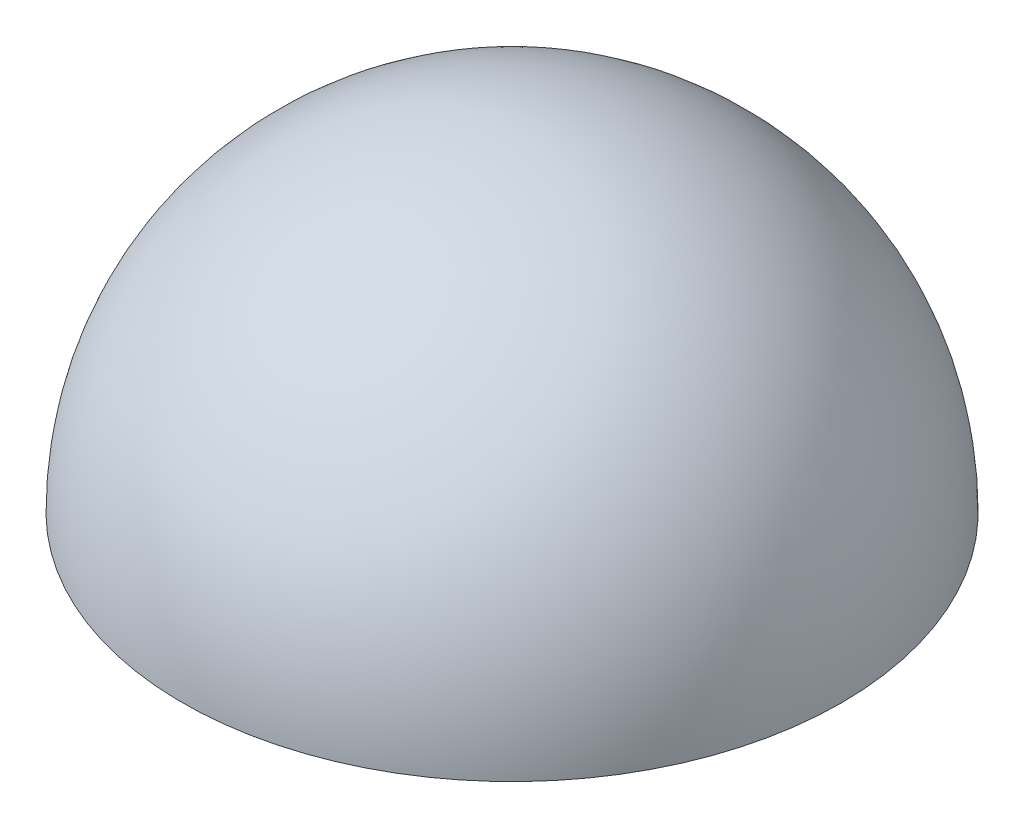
ISO-10303-21;
HEADER;
FILE_DESCRIPTION(('STEP AP214'),'2;1');
FILE_NAME('part.step','',(''),(''),'','','');
FILE_SCHEMA(('AUTOMOTIVE_DESIGN { 1 0 10303 214 1 1 1 1 }'));
ENDSEC;
DATA;
#1=APPLICATION_CONTEXT('core data for automotive mechanical design processes');
#2=APPLICATION_PROTOCOL_DEFINITION('international standard','automotive_design',2000,#1);
#3=PRODUCT_CONTEXT('',#1,'mechanical');
#4=PRODUCT('Part','Part','',(#3));
#5=PRODUCT_RELATED_PRODUCT_CATEGORY('part','',(#4));
#6=PRODUCT_DEFINITION_FORMATION('','',#4);
#7=PRODUCT_DEFINITION_CONTEXT('part definition',#1,'design');
#8=PRODUCT_DEFINITION('design','',#6,#7);
#9=PRODUCT_DEFINITION_SHAPE('','',#8);
#10=(LENGTH_UNIT() NAMED_UNIT(*) SI_UNIT(.MILLI.,.METRE.));
#11=(NAMED_UNIT(*) PLANE_ANGLE_UNIT() SI_UNIT($,.RADIAN.));
#12=(NAMED_UNIT(*) SI_UNIT($,.STERADIAN.) SOLID_ANGLE_UNIT());
#13=UNCERTAINTY_MEASURE_WITH_UNIT(LENGTH_MEASURE(1.E-05),#10,'distance_accuracy_value','');
#14=(GEOMETRIC_REPRESENTATION_CONTEXT(3) GLOBAL_UNCERTAINTY_ASSIGNED_CONTEXT((#13)) GLOBAL_UNIT_ASSIGNED_CONTEXT((#10,
#11,#12)) REPRESENTATION_CONTEXT('',''));
#15=CARTESIAN_POINT('',(0.,0.,0.));
#16=DIRECTION('',(0.,0.,1.));
#17=DIRECTION('',(1.,0.,0.));
#18=AXIS2_PLACEMENT_3D('',#15,#16,#17);
#19=CARTESIAN_POINT('',(0.0849467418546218,0.,0.));
#20=DIRECTION('',(-1.,0.,0.));
#21=DIRECTION('',(0.,0.,-1.));
#22=AXIS2_PLACEMENT_3D('',#19,#20,#21);
#23=SPHERICAL_SURFACE('',#22,21.75);
#24=CARTESIAN_POINT('',(0.0849467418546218,0.,0.));
#25=DIRECTION('',(0.,1.,0.));
#26=DIRECTION('',(0.,0.,1.));
#27=AXIS2_PLACEMENT_3D('',#24,#25,#26);
#28=SPHERICAL_SURFACE('',#27,21.75);
#29=CARTESIAN_POINT('',(0.0849467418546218,0.,0.));
#30=DIRECTION('',(0.,1.,0.));
#31=DIRECTION('',(0.,0.,1.));
#32=AXIS2_PLACEMENT_3D('',#29,#30,#31);
#33=CIRCLE('',#32,21.75);
#34=CARTESIAN_POINT('',(0.0849467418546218,-1.51879438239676E-13,21.75));
#35=VERTEX_POINT('',#34);
#36=EDGE_CURVE('E42',#35,#35,#33,.T.);
#37=ORIENTED_EDGE('',*,*,#36,.F.);
#38=EDGE_LOOP('',(#37));
#39=FACE_BOUND('',#38,.T.);
#40=ADVANCED_FACE('F35',(#39),#28,.F.);
#41=CARTESIAN_POINT('',(0.0849467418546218,0.,0.));
#42=DIRECTION('',(-1.,0.,0.));
#43=DIRECTION('',(0.,0.,1.));
#44=AXIS2_PLACEMENT_3D('',#41,#42,#43);
#45=SPHERICAL_SURFACE('',#44,23.25);
#46=CARTESIAN_POINT('',(0.0849467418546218,0.,0.));
#47=DIRECTION('',(0.,-1.,0.));
#48=DIRECTION('',(1.,0.,0.));
#49=AXIS2_PLACEMENT_3D('',#46,#47,#48);
#50=SPHERICAL_SURFACE('',#49,23.25);
#51=CARTESIAN_POINT('',(0.0849467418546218,0.,0.));
#52=DIRECTION('',(0.,-1.,0.));
#53=DIRECTION('',(1.,0.,0.));
#54=AXIS2_PLACEMENT_3D('',#51,#52,#53);
#55=CIRCLE('',#54,23.25);
#56=CARTESIAN_POINT('',(23.3349467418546,0.,0.));
#57=VERTEX_POINT('',#56);
#58=EDGE_CURVE('E10',#57,#57,#55,.F.);
#59=ORIENTED_EDGE('',*,*,#58,.T.);
#60=EDGE_LOOP('',(#59));
#61=FACE_BOUND('',#60,.T.);
#62=ADVANCED_FACE('F37',(#61),#50,.T.);
#63=CARTESIAN_POINT('',(0.0849467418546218,0.,0.));
#64=DIRECTION('',(0.,1.,0.));
#65=DIRECTION('',(-1.,0.,0.));
#66=AXIS2_PLACEMENT_3D('',#63,#64,#65);
#67=PLANE('',#66);
#68=ORIENTED_EDGE('',*,*,#36,.T.);
#69=EDGE_LOOP('',(#68));
#70=FACE_BOUND('',#69,.T.);
#71=ORIENTED_EDGE('',*,*,#58,.F.);
#72=EDGE_LOOP('',(#71));
#73=FACE_BOUND('',#72,.T.);
#74=ADVANCED_FACE('F48',(#70,#73),#67,.F.);
#75=CLOSED_SHELL('',(#40,#62,#74));
#76=MANIFOLD_SOLID_BREP('B2',#75);
#77=ADVANCED_BREP_SHAPE_REPRESENTATION('',(#18,#76),#14);
#78=SHAPE_DEFINITION_REPRESENTATION(#9,#77);
ENDSEC;
END-ISO-10303-21;
